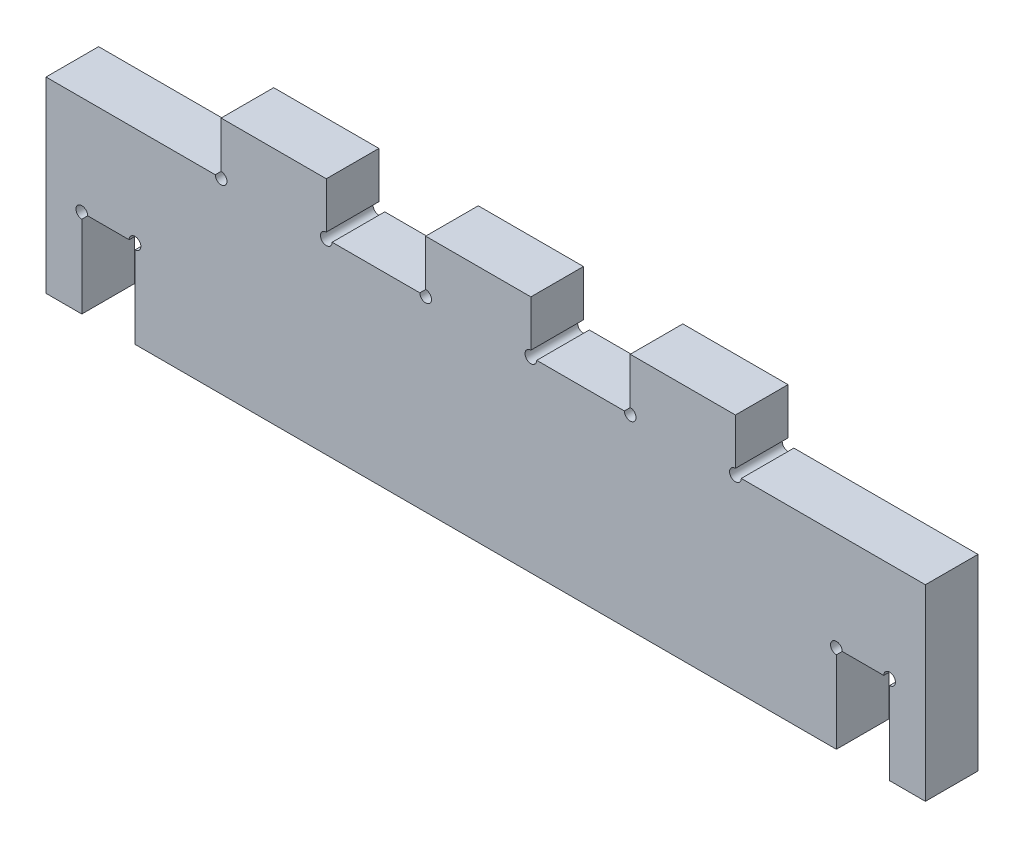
ISO-10303-21;
HEADER;
FILE_DESCRIPTION(('STEP AP214'),'2;1');
FILE_NAME('part.step','',(''),(''),'','','');
FILE_SCHEMA(('AUTOMOTIVE_DESIGN { 1 0 10303 214 1 1 1 1 }'));
ENDSEC;
DATA;
#1=APPLICATION_CONTEXT('core data for automotive mechanical design processes');
#2=APPLICATION_PROTOCOL_DEFINITION('international standard','automotive_design',2000,#1);
#3=PRODUCT_CONTEXT('',#1,'mechanical');
#4=PRODUCT('Part','Part','',(#3));
#5=PRODUCT_RELATED_PRODUCT_CATEGORY('part','',(#4));
#6=PRODUCT_DEFINITION_FORMATION('','',#4);
#7=PRODUCT_DEFINITION_CONTEXT('part definition',#1,'design');
#8=PRODUCT_DEFINITION('design','',#6,#7);
#9=PRODUCT_DEFINITION_SHAPE('','',#8);
#10=(LENGTH_UNIT() NAMED_UNIT(*) SI_UNIT(.MILLI.,.METRE.));
#11=(NAMED_UNIT(*) PLANE_ANGLE_UNIT() SI_UNIT($,.RADIAN.));
#12=(NAMED_UNIT(*) SI_UNIT($,.STERADIAN.) SOLID_ANGLE_UNIT());
#13=UNCERTAINTY_MEASURE_WITH_UNIT(LENGTH_MEASURE(1.E-05),#10,'distance_accuracy_value','');
#14=(GEOMETRIC_REPRESENTATION_CONTEXT(3) GLOBAL_UNCERTAINTY_ASSIGNED_CONTEXT((#13)) GLOBAL_UNIT_ASSIGNED_CONTEXT((#10,
#11,#12)) REPRESENTATION_CONTEXT('',''));
#15=CARTESIAN_POINT('',(0.,0.,0.));
#16=DIRECTION('',(0.,0.,1.));
#17=DIRECTION('',(1.,0.,0.));
#18=AXIS2_PLACEMENT_3D('',#15,#16,#17);
#19=CARTESIAN_POINT('',(-270.05512727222,81.9191441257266,11.0078893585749));
#20=DIRECTION('',(0.,-1.,0.));
#21=DIRECTION('',(0.,0.,-1.));
#22=AXIS2_PLACEMENT_3D('',#19,#20,#21);
#23=PLANE('',#22);
#24=DIRECTION('',(-1.,0.,0.));
#25=VECTOR('',#24,1.);
#26=CARTESIAN_POINT('',(-270.05512727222,81.9191441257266,11.0078893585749));
#27=LINE('',#26,#25);
#28=CARTESIAN_POINT('',(-212.14487272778,81.9191441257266,11.0078893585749));
#29=VERTEX_POINT('',#28);
#30=CARTESIAN_POINT('',(-270.05512727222,81.9191441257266,11.0078893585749));
#31=VERTEX_POINT('',#30);
#32=EDGE_CURVE('E432',#29,#31,#27,.T.);
#33=ORIENTED_EDGE('',*,*,#32,.F.);
#34=DIRECTION('',(0.,0.,1.));
#35=VECTOR('',#34,1.);
#36=CARTESIAN_POINT('',(-212.14487272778,81.9191441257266,-6.99311064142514));
#37=LINE('',#36,#35);
#38=CARTESIAN_POINT('',(-212.14487272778,81.9191441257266,-6.99211064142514));
#39=VERTEX_POINT('',#38);
#40=EDGE_CURVE('E469',#39,#29,#37,.T.);
#41=ORIENTED_EDGE('',*,*,#40,.F.);
#42=DIRECTION('',(-1.,0.,0.));
#43=VECTOR('',#42,1.);
#44=CARTESIAN_POINT('',(-270.05512727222,81.9191441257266,-6.99211064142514));
#45=LINE('',#44,#43);
#46=CARTESIAN_POINT('',(-270.05512727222,81.9191441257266,-6.99211064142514));
#47=VERTEX_POINT('',#46);
#48=EDGE_CURVE('E298',#39,#47,#45,.T.);
#49=ORIENTED_EDGE('',*,*,#48,.T.);
#50=DIRECTION('',(0.,0.,-1.));
#51=VECTOR('',#50,1.);
#52=CARTESIAN_POINT('',(-270.05512727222,81.9191441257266,11.0078893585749));
#53=LINE('',#52,#51);
#54=EDGE_CURVE('E339',#31,#47,#53,.T.);
#55=ORIENTED_EDGE('',*,*,#54,.F.);
#56=EDGE_LOOP('',(#33,#41,#49,#55));
#57=FACE_BOUND('',#56,.T.);
#58=ADVANCED_FACE('F33',(#57),#23,.F.);
#59=CARTESIAN_POINT('',(-142.14487272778,81.9191441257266,-6.99211064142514));
#60=VERTEX_POINT('',#59);
#61=CARTESIAN_POINT('',(-172.14487272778,81.9191441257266,-6.99211064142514));
#62=VERTEX_POINT('',#61);
#63=EDGE_CURVE('E594',#60,#62,#45,.T.);
#64=ORIENTED_EDGE('',*,*,#63,.T.);
#65=DIRECTION('',(0.,0.,1.));
#66=VECTOR('',#65,1.);
#67=CARTESIAN_POINT('',(-172.14487272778,81.9191441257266,-6.99311064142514));
#68=LINE('',#67,#66);
#69=CARTESIAN_POINT('',(-172.14487272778,81.9191441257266,11.0078893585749));
#70=VERTEX_POINT('',#69);
#71=EDGE_CURVE('E512',#70,#62,#68,.F.);
#72=ORIENTED_EDGE('',*,*,#71,.F.);
#73=CARTESIAN_POINT('',(-142.14487272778,81.9191441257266,11.0078893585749));
#74=VERTEX_POINT('',#73);
#75=EDGE_CURVE('E691',#74,#70,#27,.T.);
#76=ORIENTED_EDGE('',*,*,#75,.F.);
#77=DIRECTION('',(0.,0.,1.));
#78=VECTOR('',#77,1.);
#79=CARTESIAN_POINT('',(-142.14487272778,81.9191441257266,-6.99311064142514));
#80=LINE('',#79,#78);
#81=EDGE_CURVE('E504',#60,#74,#80,.T.);
#82=ORIENTED_EDGE('',*,*,#81,.F.);
#83=EDGE_LOOP('',(#64,#72,#76,#82));
#84=FACE_BOUND('',#83,.T.);
#85=ADVANCED_FACE('F568',(#84),#23,.F.);
#86=CARTESIAN_POINT('',(-72.1448727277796,81.9191441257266,-6.99211064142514));
#87=VERTEX_POINT('',#86);
#88=CARTESIAN_POINT('',(-102.14487272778,81.9191441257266,-6.99211064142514));
#89=VERTEX_POINT('',#88);
#90=EDGE_CURVE('E303',#87,#89,#45,.T.);
#91=ORIENTED_EDGE('',*,*,#90,.T.);
#92=DIRECTION('',(0.,0.,1.));
#93=VECTOR('',#92,1.);
#94=CARTESIAN_POINT('',(-102.14487272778,81.9191441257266,-6.99311064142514));
#95=LINE('',#94,#93);
#96=CARTESIAN_POINT('',(-102.14487272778,81.9191441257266,11.0078893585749));
#97=VERTEX_POINT('',#96);
#98=EDGE_CURVE('E495',#97,#89,#95,.F.);
#99=ORIENTED_EDGE('',*,*,#98,.F.);
#100=CARTESIAN_POINT('',(-72.1448727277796,81.9191441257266,11.0078893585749));
#101=VERTEX_POINT('',#100);
#102=EDGE_CURVE('E435',#101,#97,#27,.T.);
#103=ORIENTED_EDGE('',*,*,#102,.F.);
#104=DIRECTION('',(0.,0.,1.));
#105=VECTOR('',#104,1.);
#106=CARTESIAN_POINT('',(-72.1448727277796,81.9191441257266,-6.99311064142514));
#107=LINE('',#106,#105);
#108=EDGE_CURVE('E484',#87,#101,#107,.T.);
#109=ORIENTED_EDGE('',*,*,#108,.F.);
#110=EDGE_LOOP('',(#91,#99,#103,#109));
#111=FACE_BOUND('',#110,.T.);
#112=ADVANCED_FACE('F575',(#111),#23,.F.);
#113=CARTESIAN_POINT('',(30.8551272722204,81.9191441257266,-6.99211064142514));
#114=VERTEX_POINT('',#113);
#115=CARTESIAN_POINT('',(-32.1448727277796,81.9191441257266,-6.99211064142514));
#116=VERTEX_POINT('',#115);
#117=EDGE_CURVE('E299',#114,#116,#45,.T.);
#118=ORIENTED_EDGE('',*,*,#117,.T.);
#119=DIRECTION('',(0.,0.,1.));
#120=VECTOR('',#119,1.);
#121=CARTESIAN_POINT('',(-32.1448727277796,81.9191441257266,-6.99311064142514));
#122=LINE('',#121,#120);
#123=CARTESIAN_POINT('',(-32.1448727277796,81.9191441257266,11.0078893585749));
#124=VERTEX_POINT('',#123);
#125=EDGE_CURVE('E369',#124,#116,#122,.F.);
#126=ORIENTED_EDGE('',*,*,#125,.F.);
#127=CARTESIAN_POINT('',(30.8551272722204,81.9191441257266,11.0078893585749));
#128=VERTEX_POINT('',#127);
#129=EDGE_CURVE('E349',#128,#124,#27,.T.);
#130=ORIENTED_EDGE('',*,*,#129,.F.);
#131=DIRECTION('',(0.,0.,-1.));
#132=VECTOR('',#131,1.);
#133=CARTESIAN_POINT('',(30.8551272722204,81.9191441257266,11.0078893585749));
#134=LINE('',#133,#132);
#135=EDGE_CURVE('E41',#128,#114,#134,.T.);
#136=ORIENTED_EDGE('',*,*,#135,.T.);
#137=EDGE_LOOP('',(#118,#126,#130,#136));
#138=FACE_BOUND('',#137,.T.);
#139=ADVANCED_FACE('F346',(#138),#23,.F.);
#140=CARTESIAN_POINT('',(30.8551272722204,17.7207711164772,11.0078893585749));
#141=DIRECTION('',(0.,1.,0.));
#142=DIRECTION('',(0.,0.,1.));
#143=AXIS2_PLACEMENT_3D('',#140,#141,#142);
#144=PLANE('',#143);
#145=DIRECTION('',(1.,0.,0.));
#146=VECTOR('',#145,1.);
#147=CARTESIAN_POINT('',(30.8551272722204,17.7207711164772,-6.99211064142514));
#148=LINE('',#147,#146);
#149=CARTESIAN_POINT('',(18.6,17.7207711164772,-6.99211064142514));
#150=VERTEX_POINT('',#149);
#151=CARTESIAN_POINT('',(30.8551272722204,17.7207711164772,-6.99211064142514));
#152=VERTEX_POINT('',#151);
#153=EDGE_CURVE('E292',#150,#152,#148,.T.);
#154=ORIENTED_EDGE('',*,*,#153,.T.);
#155=DIRECTION('',(0.,0.,-1.));
#156=VECTOR('',#155,1.);
#157=CARTESIAN_POINT('',(30.8551272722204,17.7207711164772,11.0078893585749));
#158=LINE('',#157,#156);
#159=CARTESIAN_POINT('',(30.8551272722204,17.7207711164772,11.0078893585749));
#160=VERTEX_POINT('',#159);
#161=EDGE_CURVE('E11',#160,#152,#158,.T.);
#162=ORIENTED_EDGE('',*,*,#161,.F.);
#163=DIRECTION('',(1.,0.,0.));
#164=VECTOR('',#163,1.);
#165=CARTESIAN_POINT('',(30.8551272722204,17.7207711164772,11.0078893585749));
#166=LINE('',#165,#164);
#167=CARTESIAN_POINT('',(18.6,17.7207711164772,11.0078893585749));
#168=VERTEX_POINT('',#167);
#169=EDGE_CURVE('E324',#168,#160,#166,.T.);
#170=ORIENTED_EDGE('',*,*,#169,.F.);
#171=DIRECTION('',(0.,0.,-1.));
#172=VECTOR('',#171,1.);
#173=CARTESIAN_POINT('',(18.6,17.7207711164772,11.0078893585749));
#174=LINE('',#173,#172);
#175=EDGE_CURVE('E291',#168,#150,#174,.T.);
#176=ORIENTED_EDGE('',*,*,#175,.T.);
#177=EDGE_LOOP('',(#154,#162,#170,#176));
#178=FACE_BOUND('',#177,.T.);
#179=ADVANCED_FACE('F35',(#178),#144,.F.);
#180=CARTESIAN_POINT('',(30.8551272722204,81.9191441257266,11.0078893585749));
#181=DIRECTION('',(-1.,0.,0.));
#182=DIRECTION('',(0.,-1.,0.));
#183=AXIS2_PLACEMENT_3D('',#180,#181,#182);
#184=PLANE('',#183);
#185=DIRECTION('',(0.,1.,0.));
#186=VECTOR('',#185,1.);
#187=CARTESIAN_POINT('',(30.8551272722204,81.9191441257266,-6.99211064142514));
#188=LINE('',#187,#186);
#189=EDGE_CURVE('E295',#152,#114,#188,.T.);
#190=ORIENTED_EDGE('',*,*,#189,.T.);
#191=ORIENTED_EDGE('',*,*,#135,.F.);
#192=DIRECTION('',(0.,1.,0.));
#193=VECTOR('',#192,1.);
#194=CARTESIAN_POINT('',(30.8551272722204,81.9191441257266,11.0078893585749));
#195=LINE('',#194,#193);
#196=EDGE_CURVE('E430',#160,#128,#195,.T.);
#197=ORIENTED_EDGE('',*,*,#196,.F.);
#198=ORIENTED_EDGE('',*,*,#161,.T.);
#199=EDGE_LOOP('',(#190,#191,#197,#198));
#200=FACE_BOUND('',#199,.T.);
#201=ADVANCED_FACE('F523',(#200),#184,.F.);
#202=CARTESIAN_POINT('',(-270.05512727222,17.8016269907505,11.0078893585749));
#203=DIRECTION('',(1.,0.,0.));
#204=DIRECTION('',(0.,0.,-1.));
#205=AXIS2_PLACEMENT_3D('',#202,#203,#204);
#206=PLANE('',#205);
#207=DIRECTION('',(0.,-1.,0.));
#208=VECTOR('',#207,1.);
#209=CARTESIAN_POINT('',(-270.05512727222,17.8016269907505,-6.99211064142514));
#210=LINE('',#209,#208);
#211=CARTESIAN_POINT('',(-270.05512727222,17.8016269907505,-6.99211064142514));
#212=VERTEX_POINT('',#211);
#213=EDGE_CURVE('E302',#47,#212,#210,.T.);
#214=ORIENTED_EDGE('',*,*,#213,.T.);
#215=DIRECTION('',(0.,0.,-1.));
#216=VECTOR('',#215,1.);
#217=CARTESIAN_POINT('',(-270.05512727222,17.8016269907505,11.0078893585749));
#218=LINE('',#217,#216);
#219=CARTESIAN_POINT('',(-270.05512727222,17.8016269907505,11.0078893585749));
#220=VERTEX_POINT('',#219);
#221=EDGE_CURVE('E336',#220,#212,#218,.T.);
#222=ORIENTED_EDGE('',*,*,#221,.F.);
#223=DIRECTION('',(0.,-1.,0.));
#224=VECTOR('',#223,1.);
#225=CARTESIAN_POINT('',(-270.05512727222,17.8016269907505,11.0078893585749));
#226=LINE('',#225,#224);
#227=EDGE_CURVE('E434',#31,#220,#226,.T.);
#228=ORIENTED_EDGE('',*,*,#227,.F.);
#229=ORIENTED_EDGE('',*,*,#54,.T.);
#230=EDGE_LOOP('',(#214,#222,#228,#229));
#231=FACE_BOUND('',#230,.T.);
#232=ADVANCED_FACE('F604',(#231),#206,.F.);
#233=CARTESIAN_POINT('',(-257.8,17.8016269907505,11.0078893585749));
#234=DIRECTION('',(0.,1.,0.));
#235=DIRECTION('',(0.,0.,1.));
#236=AXIS2_PLACEMENT_3D('',#233,#234,#235);
#237=PLANE('',#236);
#238=DIRECTION('',(1.,0.,0.));
#239=VECTOR('',#238,1.);
#240=CARTESIAN_POINT('',(-257.8,17.8016269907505,-6.99211064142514));
#241=LINE('',#240,#239);
#242=CARTESIAN_POINT('',(-257.8,17.8016269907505,-6.99211064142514));
#243=VERTEX_POINT('',#242);
#244=EDGE_CURVE('E305',#212,#243,#241,.T.);
#245=ORIENTED_EDGE('',*,*,#244,.T.);
#246=DIRECTION('',(0.,0.,-1.));
#247=VECTOR('',#246,1.);
#248=CARTESIAN_POINT('',(-257.8,17.8016269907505,11.0078893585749));
#249=LINE('',#248,#247);
#250=CARTESIAN_POINT('',(-257.8,17.8016269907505,11.0078893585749));
#251=VERTEX_POINT('',#250);
#252=EDGE_CURVE('E333',#251,#243,#249,.T.);
#253=ORIENTED_EDGE('',*,*,#252,.F.);
#254=DIRECTION('',(1.,0.,0.));
#255=VECTOR('',#254,1.);
#256=CARTESIAN_POINT('',(-257.8,17.8016269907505,11.0078893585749));
#257=LINE('',#256,#255);
#258=EDGE_CURVE('E278',#220,#251,#257,.T.);
#259=ORIENTED_EDGE('',*,*,#258,.F.);
#260=ORIENTED_EDGE('',*,*,#221,.T.);
#261=EDGE_LOOP('',(#245,#253,#259,#260));
#262=FACE_BOUND('',#261,.T.);
#263=ADVANCED_FACE('F441',(#262),#237,.F.);
#264=CARTESIAN_POINT('',(-257.8,47.9191441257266,11.0078893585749));
#265=DIRECTION('',(-1.,0.,0.));
#266=DIRECTION('',(0.,0.,1.));
#267=AXIS2_PLACEMENT_3D('',#264,#265,#266);
#268=PLANE('',#267);
#269=DIRECTION('',(0.,1.,0.));
#270=VECTOR('',#269,1.);
#271=CARTESIAN_POINT('',(-257.8,47.9191441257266,-6.99211064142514));
#272=LINE('',#271,#270);
#273=CARTESIAN_POINT('',(-257.8,45.9191441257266,-6.99211064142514));
#274=VERTEX_POINT('',#273);
#275=EDGE_CURVE('E307',#243,#274,#272,.T.);
#276=ORIENTED_EDGE('',*,*,#275,.T.);
#277=DIRECTION('',(0.,0.,1.));
#278=VECTOR('',#277,1.);
#279=CARTESIAN_POINT('',(-257.8,45.9191441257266,-6.99311064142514));
#280=LINE('',#279,#278);
#281=CARTESIAN_POINT('',(-257.8,45.9191441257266,11.0078893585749));
#282=VERTEX_POINT('',#281);
#283=EDGE_CURVE('E48',#282,#274,#280,.F.);
#284=ORIENTED_EDGE('',*,*,#283,.F.);
#285=DIRECTION('',(0.,1.,0.));
#286=VECTOR('',#285,1.);
#287=CARTESIAN_POINT('',(-257.8,47.9191441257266,11.0078893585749));
#288=LINE('',#287,#286);
#289=EDGE_CURVE('E271',#251,#282,#288,.T.);
#290=ORIENTED_EDGE('',*,*,#289,.F.);
#291=ORIENTED_EDGE('',*,*,#252,.T.);
#292=EDGE_LOOP('',(#276,#284,#290,#291));
#293=FACE_BOUND('',#292,.T.);
#294=ADVANCED_FACE('F445',(#293),#268,.F.);
#295=CARTESIAN_POINT('',(-239.6,47.9191441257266,11.0078893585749));
#296=DIRECTION('',(0.,1.,0.));
#297=DIRECTION('',(0.,0.,1.));
#298=AXIS2_PLACEMENT_3D('',#295,#296,#297);
#299=PLANE('',#298);
#300=DIRECTION('',(1.,0.,0.));
#301=VECTOR('',#300,1.);
#302=CARTESIAN_POINT('',(-239.6,47.9191441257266,-6.99211064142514));
#303=LINE('',#302,#301);
#304=CARTESIAN_POINT('',(-255.8,47.9191441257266,-6.99211064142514));
#305=VERTEX_POINT('',#304);
#306=CARTESIAN_POINT('',(-241.6,47.9191441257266,-6.99211064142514));
#307=VERTEX_POINT('',#306);
#308=EDGE_CURVE('E310',#305,#307,#303,.T.);
#309=ORIENTED_EDGE('',*,*,#308,.T.);
#310=DIRECTION('',(0.,0.,1.));
#311=VECTOR('',#310,1.);
#312=CARTESIAN_POINT('',(-241.6,47.9191441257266,-6.99311064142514));
#313=LINE('',#312,#311);
#314=CARTESIAN_POINT('',(-241.6,47.9191441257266,11.0078893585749));
#315=VERTEX_POINT('',#314);
#316=EDGE_CURVE('E56',#315,#307,#313,.F.);
#317=ORIENTED_EDGE('',*,*,#316,.F.);
#318=DIRECTION('',(1.,0.,0.));
#319=VECTOR('',#318,1.);
#320=CARTESIAN_POINT('',(-239.6,47.9191441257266,11.0078893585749));
#321=LINE('',#320,#319);
#322=CARTESIAN_POINT('',(-255.8,47.9191441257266,11.0078893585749));
#323=VERTEX_POINT('',#322);
#324=EDGE_CURVE('E269',#323,#315,#321,.T.);
#325=ORIENTED_EDGE('',*,*,#324,.F.);
#326=DIRECTION('',(0.,0.,1.));
#327=VECTOR('',#326,1.);
#328=CARTESIAN_POINT('',(-255.8,47.9191441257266,-6.99311064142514));
#329=LINE('',#328,#327);
#330=EDGE_CURVE('E252',#305,#323,#329,.T.);
#331=ORIENTED_EDGE('',*,*,#330,.F.);
#332=EDGE_LOOP('',(#309,#317,#325,#331));
#333=FACE_BOUND('',#332,.T.);
#334=ADVANCED_FACE('F273',(#333),#299,.F.);
#335=CARTESIAN_POINT('',(-239.6,17.9191441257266,11.0078893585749));
#336=DIRECTION('',(1.,0.,0.));
#337=DIRECTION('',(0.,0.,-1.));
#338=AXIS2_PLACEMENT_3D('',#335,#336,#337);
#339=PLANE('',#338);
#340=DIRECTION('',(0.,-1.,0.));
#341=VECTOR('',#340,1.);
#342=CARTESIAN_POINT('',(-239.6,17.9191441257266,11.0078893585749));
#343=LINE('',#342,#341);
#344=CARTESIAN_POINT('',(-239.6,45.9191441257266,11.0078893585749));
#345=VERTEX_POINT('',#344);
#346=CARTESIAN_POINT('',(-239.6,17.9191441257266,11.0078893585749));
#347=VERTEX_POINT('',#346);
#348=EDGE_CURVE('E274',#345,#347,#343,.T.);
#349=ORIENTED_EDGE('',*,*,#348,.F.);
#350=DIRECTION('',(0.,0.,1.));
#351=VECTOR('',#350,1.);
#352=CARTESIAN_POINT('',(-239.6,45.9191441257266,-6.99311064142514));
#353=LINE('',#352,#351);
#354=CARTESIAN_POINT('',(-239.6,45.9191441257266,-6.99211064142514));
#355=VERTEX_POINT('',#354);
#356=EDGE_CURVE('E449',#355,#345,#353,.T.);
#357=ORIENTED_EDGE('',*,*,#356,.F.);
#358=DIRECTION('',(0.,-1.,0.));
#359=VECTOR('',#358,1.);
#360=CARTESIAN_POINT('',(-239.6,17.9191441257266,-6.99211064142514));
#361=LINE('',#360,#359);
#362=CARTESIAN_POINT('',(-239.6,17.9191441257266,-6.99211064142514));
#363=VERTEX_POINT('',#362);
#364=EDGE_CURVE('E312',#355,#363,#361,.T.);
#365=ORIENTED_EDGE('',*,*,#364,.T.);
#366=DIRECTION('',(0.,0.,-1.));
#367=VECTOR('',#366,1.);
#368=CARTESIAN_POINT('',(-239.6,17.9191441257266,11.0078893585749));
#369=LINE('',#368,#367);
#370=EDGE_CURVE('E330',#347,#363,#369,.T.);
#371=ORIENTED_EDGE('',*,*,#370,.F.);
#372=EDGE_LOOP('',(#349,#357,#365,#371));
#373=FACE_BOUND('',#372,.T.);
#374=ADVANCED_FACE('F557',(#373),#339,.F.);
#375=CARTESIAN_POINT('',(0.400000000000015,17.9191441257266,11.0078893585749));
#376=DIRECTION('',(0.,1.,0.));
#377=DIRECTION('',(-1.,0.,0.));
#378=AXIS2_PLACEMENT_3D('',#375,#376,#377);
#379=PLANE('',#378);
#380=DIRECTION('',(1.,0.,0.));
#381=VECTOR('',#380,1.);
#382=CARTESIAN_POINT('',(0.400000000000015,17.9191441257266,-6.99211064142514));
#383=LINE('',#382,#381);
#384=CARTESIAN_POINT('',(0.400000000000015,17.9191441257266,-6.99211064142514));
#385=VERTEX_POINT('',#384);
#386=EDGE_CURVE('E314',#363,#385,#383,.T.);
#387=ORIENTED_EDGE('',*,*,#386,.T.);
#388=DIRECTION('',(0.,0.,-1.));
#389=VECTOR('',#388,1.);
#390=CARTESIAN_POINT('',(0.400000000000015,17.9191441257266,11.0078893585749));
#391=LINE('',#390,#389);
#392=CARTESIAN_POINT('',(0.400000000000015,17.9191441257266,11.0078893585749));
#393=VERTEX_POINT('',#392);
#394=EDGE_CURVE('E327',#393,#385,#391,.T.);
#395=ORIENTED_EDGE('',*,*,#394,.F.);
#396=DIRECTION('',(1.,0.,0.));
#397=VECTOR('',#396,1.);
#398=CARTESIAN_POINT('',(0.400000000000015,17.9191441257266,11.0078893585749));
#399=LINE('',#398,#397);
#400=EDGE_CURVE('E276',#347,#393,#399,.T.);
#401=ORIENTED_EDGE('',*,*,#400,.F.);
#402=ORIENTED_EDGE('',*,*,#370,.T.);
#403=EDGE_LOOP('',(#387,#395,#401,#402));
#404=FACE_BOUND('',#403,.T.);
#405=ADVANCED_FACE('F551',(#404),#379,.F.);
#406=CARTESIAN_POINT('',(0.400000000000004,47.9191441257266,11.0078893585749));
#407=DIRECTION('',(-1.,0.,0.));
#408=DIRECTION('',(0.,-1.,0.));
#409=AXIS2_PLACEMENT_3D('',#406,#407,#408);
#410=PLANE('',#409);
#411=DIRECTION('',(0.,1.,0.));
#412=VECTOR('',#411,1.);
#413=CARTESIAN_POINT('',(0.400000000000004,47.9191441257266,-6.99211064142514));
#414=LINE('',#413,#412);
#415=CARTESIAN_POINT('',(0.400000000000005,45.9191441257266,-6.99211064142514));
#416=VERTEX_POINT('',#415);
#417=EDGE_CURVE('E316',#385,#416,#414,.T.);
#418=ORIENTED_EDGE('',*,*,#417,.T.);
#419=DIRECTION('',(0.,0.,1.));
#420=VECTOR('',#419,1.);
#421=CARTESIAN_POINT('',(0.400000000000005,45.9191441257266,-6.99311064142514));
#422=LINE('',#421,#420);
#423=CARTESIAN_POINT('',(0.400000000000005,45.9191441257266,11.0078893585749));
#424=VERTEX_POINT('',#423);
#425=EDGE_CURVE('E461',#424,#416,#422,.F.);
#426=ORIENTED_EDGE('',*,*,#425,.F.);
#427=DIRECTION('',(0.,1.,0.));
#428=VECTOR('',#427,1.);
#429=CARTESIAN_POINT('',(0.400000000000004,47.9191441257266,11.0078893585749));
#430=LINE('',#429,#428);
#431=EDGE_CURVE('E283',#393,#424,#430,.T.);
#432=ORIENTED_EDGE('',*,*,#431,.F.);
#433=ORIENTED_EDGE('',*,*,#394,.T.);
#434=EDGE_LOOP('',(#418,#426,#432,#433));
#435=FACE_BOUND('',#434,.T.);
#436=ADVANCED_FACE('F546',(#435),#410,.F.);
#437=CARTESIAN_POINT('',(18.6,47.9191441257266,11.0078893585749));
#438=DIRECTION('',(0.,1.,0.));
#439=DIRECTION('',(0.,0.,1.));
#440=AXIS2_PLACEMENT_3D('',#437,#438,#439);
#441=PLANE('',#440);
#442=DIRECTION('',(1.,0.,0.));
#443=VECTOR('',#442,1.);
#444=CARTESIAN_POINT('',(18.6,47.9191441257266,-6.99211064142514));
#445=LINE('',#444,#443);
#446=CARTESIAN_POINT('',(2.4,47.9191441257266,-6.99211064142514));
#447=VERTEX_POINT('',#446);
#448=CARTESIAN_POINT('',(16.6,47.9191441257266,-6.99211064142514));
#449=VERTEX_POINT('',#448);
#450=EDGE_CURVE('E319',#447,#449,#445,.T.);
#451=ORIENTED_EDGE('',*,*,#450,.T.);
#452=DIRECTION('',(0.,0.,1.));
#453=VECTOR('',#452,1.);
#454=CARTESIAN_POINT('',(16.6,47.9191441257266,-6.99311064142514));
#455=LINE('',#454,#453);
#456=CARTESIAN_POINT('',(16.6,47.9191441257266,11.0078893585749));
#457=VERTEX_POINT('',#456);
#458=EDGE_CURVE('E452',#457,#449,#455,.F.);
#459=ORIENTED_EDGE('',*,*,#458,.F.);
#460=DIRECTION('',(1.,0.,0.));
#461=VECTOR('',#460,1.);
#462=CARTESIAN_POINT('',(18.6,47.9191441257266,11.0078893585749));
#463=LINE('',#462,#461);
#464=CARTESIAN_POINT('',(2.4,47.9191441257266,11.0078893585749));
#465=VERTEX_POINT('',#464);
#466=EDGE_CURVE('E286',#465,#457,#463,.T.);
#467=ORIENTED_EDGE('',*,*,#466,.F.);
#468=DIRECTION('',(0.,0.,1.));
#469=VECTOR('',#468,1.);
#470=CARTESIAN_POINT('',(2.4,47.9191441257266,-6.99311064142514));
#471=LINE('',#470,#469);
#472=EDGE_CURVE('E459',#447,#465,#471,.T.);
#473=ORIENTED_EDGE('',*,*,#472,.F.);
#474=EDGE_LOOP('',(#451,#459,#467,#473));
#475=FACE_BOUND('',#474,.T.);
#476=ADVANCED_FACE('F540',(#475),#441,.F.);
#477=CARTESIAN_POINT('',(18.6,17.7207711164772,11.0078893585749));
#478=DIRECTION('',(1.,0.,0.));
#479=DIRECTION('',(0.,0.,-1.));
#480=AXIS2_PLACEMENT_3D('',#477,#478,#479);
#481=PLANE('',#480);
#482=DIRECTION('',(0.,-1.,0.));
#483=VECTOR('',#482,1.);
#484=CARTESIAN_POINT('',(18.6,17.7207711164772,11.0078893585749));
#485=LINE('',#484,#483);
#486=CARTESIAN_POINT('',(18.6,45.9191441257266,11.0078893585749));
#487=VERTEX_POINT('',#486);
#488=EDGE_CURVE('E289',#487,#168,#485,.T.);
#489=ORIENTED_EDGE('',*,*,#488,.F.);
#490=DIRECTION('',(0.,0.,1.));
#491=VECTOR('',#490,1.);
#492=CARTESIAN_POINT('',(18.6,45.9191441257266,-6.99311064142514));
#493=LINE('',#492,#491);
#494=CARTESIAN_POINT('',(18.6,45.9191441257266,-6.99211064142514));
#495=VERTEX_POINT('',#494);
#496=EDGE_CURVE('E450',#495,#487,#493,.T.);
#497=ORIENTED_EDGE('',*,*,#496,.F.);
#498=DIRECTION('',(0.,-1.,0.));
#499=VECTOR('',#498,1.);
#500=CARTESIAN_POINT('',(18.6,17.7207711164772,-6.99211064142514));
#501=LINE('',#500,#499);
#502=EDGE_CURVE('E322',#495,#150,#501,.T.);
#503=ORIENTED_EDGE('',*,*,#502,.T.);
#504=ORIENTED_EDGE('',*,*,#175,.F.);
#505=EDGE_LOOP('',(#489,#497,#503,#504));
#506=FACE_BOUND('',#505,.T.);
#507=ADVANCED_FACE('F531',(#506),#481,.F.);
#508=CARTESIAN_POINT('',(0.,0.,11.0078893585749));
#509=DIRECTION('',(0.,0.,-1.));
#510=DIRECTION('',(-1.,0.,0.));
#511=AXIS2_PLACEMENT_3D('',#508,#509,#510);
#512=PLANE('',#511);
#513=DIRECTION('',(0.,-1.,0.));
#514=VECTOR('',#513,1.);
#515=CARTESIAN_POINT('',(-210.14487272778,99.7191441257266,11.0078893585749));
#516=LINE('',#515,#514);
#517=CARTESIAN_POINT('',(-210.14487272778,99.7191441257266,11.0078893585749));
#518=VERTEX_POINT('',#517);
#519=CARTESIAN_POINT('',(-210.14487272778,83.9191441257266,11.0078893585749));
#520=VERTEX_POINT('',#519);
#521=EDGE_CURVE('E387',#518,#520,#516,.T.);
#522=ORIENTED_EDGE('',*,*,#521,.T.);
#523=CARTESIAN_POINT('',(-210.14487272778,81.9191441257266,11.0078893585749));
#524=DIRECTION('',(0.,0.,1.));
#525=DIRECTION('',(1.,0.,0.));
#526=AXIS2_PLACEMENT_3D('',#523,#524,#525);
#527=CIRCLE('',#526,2.);
#528=EDGE_CURVE('E472',#29,#520,#527,.T.);
#529=ORIENTED_EDGE('',*,*,#528,.F.);
#530=ORIENTED_EDGE('',*,*,#32,.T.);
#531=ORIENTED_EDGE('',*,*,#227,.T.);
#532=ORIENTED_EDGE('',*,*,#258,.T.);
#533=ORIENTED_EDGE('',*,*,#289,.T.);
#534=CARTESIAN_POINT('',(-257.8,47.9191441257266,11.0078893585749));
#535=DIRECTION('',(0.,0.,1.));
#536=DIRECTION('',(1.,0.,0.));
#537=AXIS2_PLACEMENT_3D('',#534,#535,#536);
#538=CIRCLE('',#537,2.);
#539=EDGE_CURVE('E255',#323,#282,#538,.T.);
#540=ORIENTED_EDGE('',*,*,#539,.F.);
#541=ORIENTED_EDGE('',*,*,#324,.T.);
#542=CARTESIAN_POINT('',(-239.6,47.9191441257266,11.0078893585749));
#543=DIRECTION('',(0.,0.,1.));
#544=DIRECTION('',(1.,0.,0.));
#545=AXIS2_PLACEMENT_3D('',#542,#543,#544);
#546=CIRCLE('',#545,2.);
#547=EDGE_CURVE('E479',#345,#315,#546,.T.);
#548=ORIENTED_EDGE('',*,*,#547,.F.);
#549=ORIENTED_EDGE('',*,*,#348,.T.);
#550=ORIENTED_EDGE('',*,*,#400,.T.);
#551=ORIENTED_EDGE('',*,*,#431,.T.);
#552=CARTESIAN_POINT('',(0.400000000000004,47.9191441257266,11.0078893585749));
#553=DIRECTION('',(0.,0.,1.));
#554=DIRECTION('',(1.,0.,0.));
#555=AXIS2_PLACEMENT_3D('',#552,#553,#554);
#556=CIRCLE('',#555,2.);
#557=EDGE_CURVE('E463',#465,#424,#556,.T.);
#558=ORIENTED_EDGE('',*,*,#557,.F.);
#559=ORIENTED_EDGE('',*,*,#466,.T.);
#560=CARTESIAN_POINT('',(18.6,47.9191441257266,11.0078893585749));
#561=DIRECTION('',(0.,0.,1.));
#562=DIRECTION('',(1.,0.,0.));
#563=AXIS2_PLACEMENT_3D('',#560,#561,#562);
#564=CIRCLE('',#563,2.);
#565=EDGE_CURVE('E455',#487,#457,#564,.T.);
#566=ORIENTED_EDGE('',*,*,#565,.F.);
#567=ORIENTED_EDGE('',*,*,#488,.T.);
#568=ORIENTED_EDGE('',*,*,#169,.T.);
#569=ORIENTED_EDGE('',*,*,#196,.T.);
#570=ORIENTED_EDGE('',*,*,#129,.T.);
#571=CARTESIAN_POINT('',(-34.1448727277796,81.9191441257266,11.0078893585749));
#572=DIRECTION('',(0.,0.,1.));
#573=DIRECTION('',(1.,0.,0.));
#574=AXIS2_PLACEMENT_3D('',#571,#572,#573);
#575=CIRCLE('',#574,2.);
#576=CARTESIAN_POINT('',(-34.1448727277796,83.9191441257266,11.0078893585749));
#577=VERTEX_POINT('',#576);
#578=EDGE_CURVE('E364',#577,#124,#575,.T.);
#579=ORIENTED_EDGE('',*,*,#578,.F.);
#580=DIRECTION('',(0.,-1.,0.));
#581=VECTOR('',#580,1.);
#582=CARTESIAN_POINT('',(-34.1448727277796,99.7191441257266,11.0078893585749));
#583=LINE('',#582,#581);
#584=CARTESIAN_POINT('',(-34.1448727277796,99.7191441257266,11.0078893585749));
#585=VERTEX_POINT('',#584);
#586=EDGE_CURVE('E423',#585,#577,#583,.T.);
#587=ORIENTED_EDGE('',*,*,#586,.F.);
#588=DIRECTION('',(1.,0.,0.));
#589=VECTOR('',#588,1.);
#590=CARTESIAN_POINT('',(-70.1448727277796,99.7191441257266,11.0078893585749));
#591=LINE('',#590,#589);
#592=CARTESIAN_POINT('',(-70.1448727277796,99.7191441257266,11.0078893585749));
#593=VERTEX_POINT('',#592);
#594=EDGE_CURVE('E413',#593,#585,#591,.T.);
#595=ORIENTED_EDGE('',*,*,#594,.F.);
#596=DIRECTION('',(0.,-1.,0.));
#597=VECTOR('',#596,1.);
#598=CARTESIAN_POINT('',(-70.1448727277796,99.7191441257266,11.0078893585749));
#599=LINE('',#598,#597);
#600=CARTESIAN_POINT('',(-70.1448727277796,83.9191441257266,11.0078893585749));
#601=VERTEX_POINT('',#600);
#602=EDGE_CURVE('E296',#593,#601,#599,.T.);
#603=ORIENTED_EDGE('',*,*,#602,.T.);
#604=CARTESIAN_POINT('',(-70.1448727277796,81.9191441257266,11.0078893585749));
#605=DIRECTION('',(0.,0.,1.));
#606=DIRECTION('',(1.,0.,0.));
#607=AXIS2_PLACEMENT_3D('',#604,#605,#606);
#608=CIRCLE('',#607,2.);
#609=EDGE_CURVE('E487',#101,#601,#608,.T.);
#610=ORIENTED_EDGE('',*,*,#609,.F.);
#611=ORIENTED_EDGE('',*,*,#102,.T.);
#612=CARTESIAN_POINT('',(-104.14487272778,81.9191441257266,11.0078893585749));
#613=DIRECTION('',(0.,0.,1.));
#614=DIRECTION('',(1.,0.,0.));
#615=AXIS2_PLACEMENT_3D('',#612,#613,#614);
#616=CIRCLE('',#615,2.);
#617=CARTESIAN_POINT('',(-104.14487272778,83.9191441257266,11.0078893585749));
#618=VERTEX_POINT('',#617);
#619=EDGE_CURVE('E498',#618,#97,#616,.T.);
#620=ORIENTED_EDGE('',*,*,#619,.F.);
#621=DIRECTION('',(0.,-1.,0.));
#622=VECTOR('',#621,1.);
#623=CARTESIAN_POINT('',(-104.14487272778,99.7191441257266,11.0078893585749));
#624=LINE('',#623,#622);
#625=CARTESIAN_POINT('',(-104.14487272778,99.7191441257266,11.0078893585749));
#626=VERTEX_POINT('',#625);
#627=EDGE_CURVE('E404',#626,#618,#624,.T.);
#628=ORIENTED_EDGE('',*,*,#627,.F.);
#629=DIRECTION('',(1.,0.,0.));
#630=VECTOR('',#629,1.);
#631=CARTESIAN_POINT('',(-140.14487272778,99.7191441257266,11.0078893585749));
#632=LINE('',#631,#630);
#633=CARTESIAN_POINT('',(-140.14487272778,99.7191441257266,11.0078893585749));
#634=VERTEX_POINT('',#633);
#635=EDGE_CURVE('E392',#634,#626,#632,.T.);
#636=ORIENTED_EDGE('',*,*,#635,.F.);
#637=DIRECTION('',(0.,-1.,0.));
#638=VECTOR('',#637,1.);
#639=CARTESIAN_POINT('',(-140.14487272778,99.7191441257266,11.0078893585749));
#640=LINE('',#639,#638);
#641=CARTESIAN_POINT('',(-140.14487272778,83.9191441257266,11.0078893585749));
#642=VERTEX_POINT('',#641);
#643=EDGE_CURVE('E407',#634,#642,#640,.T.);
#644=ORIENTED_EDGE('',*,*,#643,.T.);
#645=CARTESIAN_POINT('',(-140.14487272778,81.9191441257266,11.0078893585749));
#646=DIRECTION('',(0.,0.,1.));
#647=DIRECTION('',(1.,0.,0.));
#648=AXIS2_PLACEMENT_3D('',#645,#646,#647);
#649=CIRCLE('',#648,2.);
#650=EDGE_CURVE('E507',#74,#642,#649,.T.);
#651=ORIENTED_EDGE('',*,*,#650,.F.);
#652=ORIENTED_EDGE('',*,*,#75,.T.);
#653=CARTESIAN_POINT('',(-174.14487272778,81.9191441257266,11.0078893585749));
#654=DIRECTION('',(0.,0.,1.));
#655=DIRECTION('',(1.,0.,0.));
#656=AXIS2_PLACEMENT_3D('',#653,#654,#655);
#657=CIRCLE('',#656,2.);
#658=CARTESIAN_POINT('',(-174.14487272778,83.9191441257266,11.0078893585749));
#659=VERTEX_POINT('',#658);
#660=EDGE_CURVE('E514',#659,#70,#657,.T.);
#661=ORIENTED_EDGE('',*,*,#660,.F.);
#662=DIRECTION('',(0.,-1.,0.));
#663=VECTOR('',#662,1.);
#664=CARTESIAN_POINT('',(-174.14487272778,99.7191441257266,11.0078893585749));
#665=LINE('',#664,#663);
#666=CARTESIAN_POINT('',(-174.14487272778,99.7191441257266,11.0078893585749));
#667=VERTEX_POINT('',#666);
#668=EDGE_CURVE('E384',#667,#659,#665,.T.);
#669=ORIENTED_EDGE('',*,*,#668,.F.);
#670=DIRECTION('',(1.,0.,0.));
#671=VECTOR('',#670,1.);
#672=CARTESIAN_POINT('',(-210.14487272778,99.7191441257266,11.0078893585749));
#673=LINE('',#672,#671);
#674=EDGE_CURVE('E367',#518,#667,#673,.T.);
#675=ORIENTED_EDGE('',*,*,#674,.F.);
#676=EDGE_LOOP('',(#522,#529,#530,#531,#532,#533,#540,#541,#548,#549,#550,#551,#558,#559,#566,
#567,#568,#569,#570,#579,#587,#595,#603,#610,#611,#620,#628,#636,#644,#651,#652,#661,#669,#675));
#677=FACE_BOUND('',#676,.T.);
#678=ADVANCED_FACE('F267',(#677),#512,.F.);
#679=CARTESIAN_POINT('',(0.,0.,-6.99211064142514));
#680=DIRECTION('',(0.,0.,-1.));
#681=DIRECTION('',(-1.,0.,0.));
#682=AXIS2_PLACEMENT_3D('',#679,#680,#681);
#683=PLANE('',#682);
#684=CARTESIAN_POINT('',(-210.14487272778,81.9191441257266,-6.99211064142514));
#685=DIRECTION('',(0.,0.,-1.));
#686=DIRECTION('',(-1.,0.,0.));
#687=AXIS2_PLACEMENT_3D('',#684,#685,#686);
#688=CIRCLE('',#687,2.);
#689=CARTESIAN_POINT('',(-210.14487272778,83.9191441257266,-6.9921106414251));
#690=VERTEX_POINT('',#689);
#691=EDGE_CURVE('E474',#39,#690,#688,.F.);
#692=ORIENTED_EDGE('',*,*,#691,.T.);
#693=DIRECTION('',(0.,-1.,0.));
#694=VECTOR('',#693,1.);
#695=CARTESIAN_POINT('',(-210.14487272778,99.7191441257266,-6.9921106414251));
#696=LINE('',#695,#694);
#697=CARTESIAN_POINT('',(-210.14487272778,99.7191441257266,-6.9921106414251));
#698=VERTEX_POINT('',#697);
#699=EDGE_CURVE('E378',#698,#690,#696,.T.);
#700=ORIENTED_EDGE('',*,*,#699,.F.);
#701=DIRECTION('',(-1.,0.,0.));
#702=VECTOR('',#701,1.);
#703=CARTESIAN_POINT('',(-210.14487272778,99.7191441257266,-6.9921106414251));
#704=LINE('',#703,#702);
#705=CARTESIAN_POINT('',(-174.14487272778,99.7191441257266,-6.99211064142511));
#706=VERTEX_POINT('',#705);
#707=EDGE_CURVE('E376',#706,#698,#704,.T.);
#708=ORIENTED_EDGE('',*,*,#707,.F.);
#709=DIRECTION('',(0.,-1.,0.));
#710=VECTOR('',#709,1.);
#711=CARTESIAN_POINT('',(-174.14487272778,99.7191441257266,-6.99211064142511));
#712=LINE('',#711,#710);
#713=CARTESIAN_POINT('',(-174.14487272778,83.9191441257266,-6.99211064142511));
#714=VERTEX_POINT('',#713);
#715=EDGE_CURVE('E381',#706,#714,#712,.T.);
#716=ORIENTED_EDGE('',*,*,#715,.T.);
#717=CARTESIAN_POINT('',(-174.14487272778,81.9191441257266,-6.99211064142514));
#718=DIRECTION('',(0.,0.,-1.));
#719=DIRECTION('',(-1.,0.,0.));
#720=AXIS2_PLACEMENT_3D('',#717,#718,#719);
#721=CIRCLE('',#720,2.);
#722=EDGE_CURVE('E505',#714,#62,#721,.F.);
#723=ORIENTED_EDGE('',*,*,#722,.T.);
#724=ORIENTED_EDGE('',*,*,#63,.F.);
#725=CARTESIAN_POINT('',(-140.14487272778,81.9191441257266,-6.99211064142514));
#726=DIRECTION('',(0.,0.,-1.));
#727=DIRECTION('',(-1.,0.,0.));
#728=AXIS2_PLACEMENT_3D('',#725,#726,#727);
#729=CIRCLE('',#728,2.);
#730=CARTESIAN_POINT('',(-140.14487272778,83.9191441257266,-6.9921106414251));
#731=VERTEX_POINT('',#730);
#732=EDGE_CURVE('E496',#60,#731,#729,.F.);
#733=ORIENTED_EDGE('',*,*,#732,.T.);
#734=DIRECTION('',(0.,-1.,0.));
#735=VECTOR('',#734,1.);
#736=CARTESIAN_POINT('',(-140.14487272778,99.7191441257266,-6.9921106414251));
#737=LINE('',#736,#735);
#738=CARTESIAN_POINT('',(-140.14487272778,99.7191441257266,-6.9921106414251));
#739=VERTEX_POINT('',#738);
#740=EDGE_CURVE('E398',#739,#731,#737,.T.);
#741=ORIENTED_EDGE('',*,*,#740,.F.);
#742=DIRECTION('',(-1.,0.,0.));
#743=VECTOR('',#742,1.);
#744=CARTESIAN_POINT('',(-140.14487272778,99.7191441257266,-6.9921106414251));
#745=LINE('',#744,#743);
#746=CARTESIAN_POINT('',(-104.14487272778,99.7191441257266,-6.99211064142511));
#747=VERTEX_POINT('',#746);
#748=EDGE_CURVE('E396',#747,#739,#745,.T.);
#749=ORIENTED_EDGE('',*,*,#748,.F.);
#750=DIRECTION('',(0.,-1.,0.));
#751=VECTOR('',#750,1.);
#752=CARTESIAN_POINT('',(-104.14487272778,99.7191441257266,-6.99211064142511));
#753=LINE('',#752,#751);
#754=CARTESIAN_POINT('',(-104.14487272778,83.9191441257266,-6.99211064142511));
#755=VERTEX_POINT('',#754);
#756=EDGE_CURVE('E401',#747,#755,#753,.T.);
#757=ORIENTED_EDGE('',*,*,#756,.T.);
#758=CARTESIAN_POINT('',(-104.14487272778,81.9191441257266,-6.99211064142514));
#759=DIRECTION('',(0.,0.,-1.));
#760=DIRECTION('',(-1.,0.,0.));
#761=AXIS2_PLACEMENT_3D('',#758,#759,#760);
#762=CIRCLE('',#761,2.);
#763=EDGE_CURVE('E485',#755,#89,#762,.F.);
#764=ORIENTED_EDGE('',*,*,#763,.T.);
#765=ORIENTED_EDGE('',*,*,#90,.F.);
#766=CARTESIAN_POINT('',(-70.1448727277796,81.9191441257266,-6.99211064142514));
#767=DIRECTION('',(0.,0.,-1.));
#768=DIRECTION('',(-1.,0.,0.));
#769=AXIS2_PLACEMENT_3D('',#766,#767,#768);
#770=CIRCLE('',#769,2.);
#771=CARTESIAN_POINT('',(-70.1448727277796,83.9191441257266,-6.99211064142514));
#772=VERTEX_POINT('',#771);
#773=EDGE_CURVE('E489',#87,#772,#770,.F.);
#774=ORIENTED_EDGE('',*,*,#773,.T.);
#775=DIRECTION('',(0.,-1.,0.));
#776=VECTOR('',#775,1.);
#777=CARTESIAN_POINT('',(-70.1448727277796,99.7191441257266,-6.9921106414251));
#778=LINE('',#777,#776);
#779=CARTESIAN_POINT('',(-70.1448727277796,99.7191441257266,-6.9921106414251));
#780=VERTEX_POINT('',#779);
#781=EDGE_CURVE('E419',#780,#772,#778,.T.);
#782=ORIENTED_EDGE('',*,*,#781,.F.);
#783=DIRECTION('',(-1.,0.,0.));
#784=VECTOR('',#783,1.);
#785=CARTESIAN_POINT('',(-70.1448727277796,99.7191441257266,-6.9921106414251));
#786=LINE('',#785,#784);
#787=CARTESIAN_POINT('',(-34.1448727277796,99.7191441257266,-6.99211064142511));
#788=VERTEX_POINT('',#787);
#789=EDGE_CURVE('E417',#788,#780,#786,.T.);
#790=ORIENTED_EDGE('',*,*,#789,.F.);
#791=DIRECTION('',(0.,-1.,0.));
#792=VECTOR('',#791,1.);
#793=CARTESIAN_POINT('',(-34.1448727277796,99.7191441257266,-6.99211064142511));
#794=LINE('',#793,#792);
#795=CARTESIAN_POINT('',(-34.1448727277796,83.9191441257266,-6.99211064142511));
#796=VERTEX_POINT('',#795);
#797=EDGE_CURVE('E360',#788,#796,#794,.T.);
#798=ORIENTED_EDGE('',*,*,#797,.T.);
#799=CARTESIAN_POINT('',(-34.1448727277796,81.9191441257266,-6.99211064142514));
#800=DIRECTION('',(0.,0.,-1.));
#801=DIRECTION('',(-1.,0.,0.));
#802=AXIS2_PLACEMENT_3D('',#799,#800,#801);
#803=CIRCLE('',#802,2.);
#804=EDGE_CURVE('E357',#796,#116,#803,.F.);
#805=ORIENTED_EDGE('',*,*,#804,.T.);
#806=ORIENTED_EDGE('',*,*,#117,.F.);
#807=ORIENTED_EDGE('',*,*,#189,.F.);
#808=ORIENTED_EDGE('',*,*,#153,.F.);
#809=ORIENTED_EDGE('',*,*,#502,.F.);
#810=CARTESIAN_POINT('',(18.6,47.9191441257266,-6.99211064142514));
#811=DIRECTION('',(0.,0.,-1.));
#812=DIRECTION('',(-1.,0.,0.));
#813=AXIS2_PLACEMENT_3D('',#810,#811,#812);
#814=CIRCLE('',#813,2.);
#815=EDGE_CURVE('E261',#495,#449,#814,.F.);
#816=ORIENTED_EDGE('',*,*,#815,.T.);
#817=ORIENTED_EDGE('',*,*,#450,.F.);
#818=CARTESIAN_POINT('',(0.400000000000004,47.9191441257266,-6.99211064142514));
#819=DIRECTION('',(0.,0.,-1.));
#820=DIRECTION('',(-1.,0.,0.));
#821=AXIS2_PLACEMENT_3D('',#818,#819,#820);
#822=CIRCLE('',#821,2.);
#823=EDGE_CURVE('E453',#447,#416,#822,.F.);
#824=ORIENTED_EDGE('',*,*,#823,.T.);
#825=ORIENTED_EDGE('',*,*,#417,.F.);
#826=ORIENTED_EDGE('',*,*,#386,.F.);
#827=ORIENTED_EDGE('',*,*,#364,.F.);
#828=CARTESIAN_POINT('',(-239.6,47.9191441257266,-6.99211064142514));
#829=DIRECTION('',(0.,0.,-1.));
#830=DIRECTION('',(-1.,0.,0.));
#831=AXIS2_PLACEMENT_3D('',#828,#829,#830);
#832=CIRCLE('',#831,2.);
#833=EDGE_CURVE('E470',#355,#307,#832,.F.);
#834=ORIENTED_EDGE('',*,*,#833,.T.);
#835=ORIENTED_EDGE('',*,*,#308,.F.);
#836=CARTESIAN_POINT('',(-257.8,47.9191441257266,-6.99211064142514));
#837=DIRECTION('',(0.,0.,-1.));
#838=DIRECTION('',(-1.,0.,0.));
#839=AXIS2_PLACEMENT_3D('',#836,#837,#838);
#840=CIRCLE('',#839,2.);
#841=EDGE_CURVE('E256',#305,#274,#840,.F.);
#842=ORIENTED_EDGE('',*,*,#841,.T.);
#843=ORIENTED_EDGE('',*,*,#275,.F.);
#844=ORIENTED_EDGE('',*,*,#244,.F.);
#845=ORIENTED_EDGE('',*,*,#213,.F.);
#846=ORIENTED_EDGE('',*,*,#48,.F.);
#847=EDGE_LOOP('',(#692,#700,#708,#716,#723,#724,#733,#741,#749,#757,#764,#765,#774,#782,#790,
#798,#805,#806,#807,#808,#809,#816,#817,#824,#825,#826,#827,#834,#835,#842,#843,#844,#845,#846));
#848=FACE_BOUND('',#847,.T.);
#849=ADVANCED_FACE('F354',(#848),#683,.T.);
#850=CARTESIAN_POINT('',(-70.1448727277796,99.7191441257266,11.0078893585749));
#851=DIRECTION('',(1.,0.,0.));
#852=DIRECTION('',(0.,0.,-1.));
#853=AXIS2_PLACEMENT_3D('',#850,#851,#852);
#854=PLANE('',#853);
#855=ORIENTED_EDGE('',*,*,#781,.T.);
#856=DIRECTION('',(0.,0.,1.));
#857=VECTOR('',#856,1.);
#858=CARTESIAN_POINT('',(-70.1448727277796,83.9191441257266,-6.99311064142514));
#859=LINE('',#858,#857);
#860=EDGE_CURVE('E482',#601,#772,#859,.F.);
#861=ORIENTED_EDGE('',*,*,#860,.F.);
#862=ORIENTED_EDGE('',*,*,#602,.F.);
#863=DIRECTION('',(0.,0.,1.));
#864=VECTOR('',#863,1.);
#865=CARTESIAN_POINT('',(-70.1448727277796,99.7191441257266,11.0078893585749));
#866=LINE('',#865,#864);
#867=EDGE_CURVE('E410',#780,#593,#866,.T.);
#868=ORIENTED_EDGE('',*,*,#867,.F.);
#869=EDGE_LOOP('',(#855,#861,#862,#868));
#870=FACE_BOUND('',#869,.T.);
#871=ADVANCED_FACE('F627',(#870),#854,.F.);
#872=CARTESIAN_POINT('',(-34.1448727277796,99.7191441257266,11.0078893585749));
#873=DIRECTION('',(-1.,0.,0.));
#874=DIRECTION('',(0.,0.,1.));
#875=AXIS2_PLACEMENT_3D('',#872,#873,#874);
#876=PLANE('',#875);
#877=ORIENTED_EDGE('',*,*,#586,.T.);
#878=DIRECTION('',(0.,0.,1.));
#879=VECTOR('',#878,1.);
#880=CARTESIAN_POINT('',(-34.1448727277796,83.9191441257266,-6.99311064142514));
#881=LINE('',#880,#879);
#882=EDGE_CURVE('E492',#796,#577,#881,.T.);
#883=ORIENTED_EDGE('',*,*,#882,.F.);
#884=ORIENTED_EDGE('',*,*,#797,.F.);
#885=DIRECTION('',(0.,0.,-1.));
#886=VECTOR('',#885,1.);
#887=CARTESIAN_POINT('',(-34.1448727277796,99.7191441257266,11.0078893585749));
#888=LINE('',#887,#886);
#889=EDGE_CURVE('E415',#585,#788,#888,.T.);
#890=ORIENTED_EDGE('',*,*,#889,.F.);
#891=EDGE_LOOP('',(#877,#883,#884,#890));
#892=FACE_BOUND('',#891,.T.);
#893=ADVANCED_FACE('F632',(#892),#876,.F.);
#894=CARTESIAN_POINT('',(0.,99.7191441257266,0.));
#895=DIRECTION('',(0.,-1.,0.));
#896=DIRECTION('',(0.,0.,-1.));
#897=AXIS2_PLACEMENT_3D('',#894,#895,#896);
#898=PLANE('',#897);
#899=ORIENTED_EDGE('',*,*,#867,.T.);
#900=ORIENTED_EDGE('',*,*,#594,.T.);
#901=ORIENTED_EDGE('',*,*,#889,.T.);
#902=ORIENTED_EDGE('',*,*,#789,.T.);
#903=EDGE_LOOP('',(#899,#900,#901,#902));
#904=FACE_BOUND('',#903,.T.);
#905=ADVANCED_FACE('F636',(#904),#898,.F.);
#906=CARTESIAN_POINT('',(-140.14487272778,99.7191441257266,11.0078893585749));
#907=DIRECTION('',(1.,0.,0.));
#908=DIRECTION('',(0.,0.,-1.));
#909=AXIS2_PLACEMENT_3D('',#906,#907,#908);
#910=PLANE('',#909);
#911=ORIENTED_EDGE('',*,*,#740,.T.);
#912=DIRECTION('',(0.,0.,1.));
#913=VECTOR('',#912,1.);
#914=CARTESIAN_POINT('',(-140.14487272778,83.9191441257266,-6.99311064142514));
#915=LINE('',#914,#913);
#916=EDGE_CURVE('E502',#642,#731,#915,.F.);
#917=ORIENTED_EDGE('',*,*,#916,.F.);
#918=ORIENTED_EDGE('',*,*,#643,.F.);
#919=DIRECTION('',(0.,0.,1.));
#920=VECTOR('',#919,1.);
#921=CARTESIAN_POINT('',(-140.14487272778,99.7191441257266,11.0078893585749));
#922=LINE('',#921,#920);
#923=EDGE_CURVE('E389',#739,#634,#922,.T.);
#924=ORIENTED_EDGE('',*,*,#923,.F.);
#925=EDGE_LOOP('',(#911,#917,#918,#924));
#926=FACE_BOUND('',#925,.T.);
#927=ADVANCED_FACE('F640',(#926),#910,.F.);
#928=CARTESIAN_POINT('',(-104.14487272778,99.7191441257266,11.0078893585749));
#929=DIRECTION('',(-1.,0.,0.));
#930=DIRECTION('',(0.,0.,1.));
#931=AXIS2_PLACEMENT_3D('',#928,#929,#930);
#932=PLANE('',#931);
#933=ORIENTED_EDGE('',*,*,#627,.T.);
#934=DIRECTION('',(0.,0.,1.));
#935=VECTOR('',#934,1.);
#936=CARTESIAN_POINT('',(-104.14487272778,83.9191441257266,-6.99311064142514));
#937=LINE('',#936,#935);
#938=EDGE_CURVE('E493',#755,#618,#937,.T.);
#939=ORIENTED_EDGE('',*,*,#938,.F.);
#940=ORIENTED_EDGE('',*,*,#756,.F.);
#941=DIRECTION('',(0.,0.,-1.));
#942=VECTOR('',#941,1.);
#943=CARTESIAN_POINT('',(-104.14487272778,99.7191441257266,11.0078893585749));
#944=LINE('',#943,#942);
#945=EDGE_CURVE('E394',#626,#747,#944,.T.);
#946=ORIENTED_EDGE('',*,*,#945,.F.);
#947=EDGE_LOOP('',(#933,#939,#940,#946));
#948=FACE_BOUND('',#947,.T.);
#949=ADVANCED_FACE('F644',(#948),#932,.F.);
#950=CARTESIAN_POINT('',(-70.,99.7191441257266,0.));
#951=DIRECTION('',(0.,-1.,0.));
#952=DIRECTION('',(0.,0.,-1.));
#953=AXIS2_PLACEMENT_3D('',#950,#951,#952);
#954=PLANE('',#953);
#955=ORIENTED_EDGE('',*,*,#923,.T.);
#956=ORIENTED_EDGE('',*,*,#635,.T.);
#957=ORIENTED_EDGE('',*,*,#945,.T.);
#958=ORIENTED_EDGE('',*,*,#748,.T.);
#959=EDGE_LOOP('',(#955,#956,#957,#958));
#960=FACE_BOUND('',#959,.T.);
#961=ADVANCED_FACE('F648',(#960),#954,.F.);
#962=CARTESIAN_POINT('',(-210.14487272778,99.7191441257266,11.0078893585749));
#963=DIRECTION('',(1.,0.,0.));
#964=DIRECTION('',(0.,0.,-1.));
#965=AXIS2_PLACEMENT_3D('',#962,#963,#964);
#966=PLANE('',#965);
#967=ORIENTED_EDGE('',*,*,#699,.T.);
#968=DIRECTION('',(0.,0.,1.));
#969=VECTOR('',#968,1.);
#970=CARTESIAN_POINT('',(-210.14487272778,83.9191441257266,-6.99311064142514));
#971=LINE('',#970,#969);
#972=EDGE_CURVE('E467',#520,#690,#971,.F.);
#973=ORIENTED_EDGE('',*,*,#972,.F.);
#974=ORIENTED_EDGE('',*,*,#521,.F.);
#975=DIRECTION('',(0.,0.,1.));
#976=VECTOR('',#975,1.);
#977=CARTESIAN_POINT('',(-210.14487272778,99.7191441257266,11.0078893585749));
#978=LINE('',#977,#976);
#979=EDGE_CURVE('E363',#698,#518,#978,.T.);
#980=ORIENTED_EDGE('',*,*,#979,.F.);
#981=EDGE_LOOP('',(#967,#973,#974,#980));
#982=FACE_BOUND('',#981,.T.);
#983=ADVANCED_FACE('F652',(#982),#966,.F.);
#984=CARTESIAN_POINT('',(-174.14487272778,99.7191441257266,11.0078893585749));
#985=DIRECTION('',(-1.,0.,0.));
#986=DIRECTION('',(0.,0.,1.));
#987=AXIS2_PLACEMENT_3D('',#984,#985,#986);
#988=PLANE('',#987);
#989=ORIENTED_EDGE('',*,*,#668,.T.);
#990=DIRECTION('',(0.,0.,1.));
#991=VECTOR('',#990,1.);
#992=CARTESIAN_POINT('',(-174.14487272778,83.9191441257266,-6.99311064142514));
#993=LINE('',#992,#991);
#994=EDGE_CURVE('E476',#714,#659,#993,.T.);
#995=ORIENTED_EDGE('',*,*,#994,.F.);
#996=ORIENTED_EDGE('',*,*,#715,.F.);
#997=DIRECTION('',(0.,0.,-1.));
#998=VECTOR('',#997,1.);
#999=CARTESIAN_POINT('',(-174.14487272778,99.7191441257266,11.0078893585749));
#1000=LINE('',#999,#998);
#1001=EDGE_CURVE('E374',#667,#706,#1000,.T.);
#1002=ORIENTED_EDGE('',*,*,#1001,.F.);
#1003=EDGE_LOOP('',(#989,#995,#996,#1002));
#1004=FACE_BOUND('',#1003,.T.);
#1005=ADVANCED_FACE('F656',(#1004),#988,.F.);
#1006=CARTESIAN_POINT('',(-140.,99.7191441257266,0.));
#1007=DIRECTION('',(0.,-1.,0.));
#1008=DIRECTION('',(0.,0.,-1.));
#1009=AXIS2_PLACEMENT_3D('',#1006,#1007,#1008);
#1010=PLANE('',#1009);
#1011=ORIENTED_EDGE('',*,*,#979,.T.);
#1012=ORIENTED_EDGE('',*,*,#674,.T.);
#1013=ORIENTED_EDGE('',*,*,#1001,.T.);
#1014=ORIENTED_EDGE('',*,*,#707,.T.);
#1015=EDGE_LOOP('',(#1011,#1012,#1013,#1014));
#1016=FACE_BOUND('',#1015,.T.);
#1017=ADVANCED_FACE('F660',(#1016),#1010,.F.);
#1018=CARTESIAN_POINT('',(-34.1448727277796,81.9191441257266,-6.99311064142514));
#1019=DIRECTION('',(0.,0.,1.));
#1020=DIRECTION('',(1.,0.,0.));
#1021=AXIS2_PLACEMENT_3D('',#1018,#1019,#1020);
#1022=CYLINDRICAL_SURFACE('',#1021,2.);
#1023=ORIENTED_EDGE('',*,*,#125,.T.);
#1024=ORIENTED_EDGE('',*,*,#804,.F.);
#1025=ORIENTED_EDGE('',*,*,#882,.T.);
#1026=ORIENTED_EDGE('',*,*,#578,.T.);
#1027=EDGE_LOOP('',(#1023,#1024,#1025,#1026));
#1028=FACE_BOUND('',#1027,.T.);
#1029=ADVANCED_FACE('F518',(#1028),#1022,.F.);
#1030=CARTESIAN_POINT('',(-174.14487272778,81.9191441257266,-6.99311064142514));
#1031=DIRECTION('',(0.,0.,1.));
#1032=DIRECTION('',(1.,0.,0.));
#1033=AXIS2_PLACEMENT_3D('',#1030,#1031,#1032);
#1034=CYLINDRICAL_SURFACE('',#1033,2.);
#1035=ORIENTED_EDGE('',*,*,#71,.T.);
#1036=ORIENTED_EDGE('',*,*,#722,.F.);
#1037=ORIENTED_EDGE('',*,*,#994,.T.);
#1038=ORIENTED_EDGE('',*,*,#660,.T.);
#1039=EDGE_LOOP('',(#1035,#1036,#1037,#1038));
#1040=FACE_BOUND('',#1039,.T.);
#1041=ADVANCED_FACE('F667',(#1040),#1034,.F.);
#1042=CARTESIAN_POINT('',(-210.14487272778,81.9191441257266,-6.99311064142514));
#1043=DIRECTION('',(0.,0.,1.));
#1044=DIRECTION('',(1.,0.,0.));
#1045=AXIS2_PLACEMENT_3D('',#1042,#1043,#1044);
#1046=CYLINDRICAL_SURFACE('',#1045,2.);
#1047=ORIENTED_EDGE('',*,*,#40,.T.);
#1048=ORIENTED_EDGE('',*,*,#528,.T.);
#1049=ORIENTED_EDGE('',*,*,#972,.T.);
#1050=ORIENTED_EDGE('',*,*,#691,.F.);
#1051=EDGE_LOOP('',(#1047,#1048,#1049,#1050));
#1052=FACE_BOUND('',#1051,.T.);
#1053=ADVANCED_FACE('F670',(#1052),#1046,.F.);
#1054=CARTESIAN_POINT('',(-104.14487272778,81.9191441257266,-6.99311064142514));
#1055=DIRECTION('',(0.,0.,1.));
#1056=DIRECTION('',(1.,0.,0.));
#1057=AXIS2_PLACEMENT_3D('',#1054,#1055,#1056);
#1058=CYLINDRICAL_SURFACE('',#1057,2.);
#1059=ORIENTED_EDGE('',*,*,#98,.T.);
#1060=ORIENTED_EDGE('',*,*,#763,.F.);
#1061=ORIENTED_EDGE('',*,*,#938,.T.);
#1062=ORIENTED_EDGE('',*,*,#619,.T.);
#1063=EDGE_LOOP('',(#1059,#1060,#1061,#1062));
#1064=FACE_BOUND('',#1063,.T.);
#1065=ADVANCED_FACE('F676',(#1064),#1058,.F.);
#1066=CARTESIAN_POINT('',(-140.14487272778,81.9191441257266,-6.99311064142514));
#1067=DIRECTION('',(0.,0.,1.));
#1068=DIRECTION('',(1.,0.,0.));
#1069=AXIS2_PLACEMENT_3D('',#1066,#1067,#1068);
#1070=CYLINDRICAL_SURFACE('',#1069,2.);
#1071=ORIENTED_EDGE('',*,*,#81,.T.);
#1072=ORIENTED_EDGE('',*,*,#650,.T.);
#1073=ORIENTED_EDGE('',*,*,#916,.T.);
#1074=ORIENTED_EDGE('',*,*,#732,.F.);
#1075=EDGE_LOOP('',(#1071,#1072,#1073,#1074));
#1076=FACE_BOUND('',#1075,.T.);
#1077=ADVANCED_FACE('F672',(#1076),#1070,.F.);
#1078=CARTESIAN_POINT('',(-70.1448727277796,81.9191441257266,-6.99311064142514));
#1079=DIRECTION('',(0.,0.,1.));
#1080=DIRECTION('',(1.,0.,0.));
#1081=AXIS2_PLACEMENT_3D('',#1078,#1079,#1080);
#1082=CYLINDRICAL_SURFACE('',#1081,2.);
#1083=ORIENTED_EDGE('',*,*,#108,.T.);
#1084=ORIENTED_EDGE('',*,*,#609,.T.);
#1085=ORIENTED_EDGE('',*,*,#860,.T.);
#1086=ORIENTED_EDGE('',*,*,#773,.F.);
#1087=EDGE_LOOP('',(#1083,#1084,#1085,#1086));
#1088=FACE_BOUND('',#1087,.T.);
#1089=ADVANCED_FACE('F675',(#1088),#1082,.F.);
#1090=CARTESIAN_POINT('',(0.400000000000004,47.9191441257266,-6.99311064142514));
#1091=DIRECTION('',(0.,0.,1.));
#1092=DIRECTION('',(1.,0.,0.));
#1093=AXIS2_PLACEMENT_3D('',#1090,#1091,#1092);
#1094=CYLINDRICAL_SURFACE('',#1093,2.);
#1095=ORIENTED_EDGE('',*,*,#425,.T.);
#1096=ORIENTED_EDGE('',*,*,#823,.F.);
#1097=ORIENTED_EDGE('',*,*,#472,.T.);
#1098=ORIENTED_EDGE('',*,*,#557,.T.);
#1099=EDGE_LOOP('',(#1095,#1096,#1097,#1098));
#1100=FACE_BOUND('',#1099,.T.);
#1101=ADVANCED_FACE('F681',(#1100),#1094,.F.);
#1102=CARTESIAN_POINT('',(18.6,47.9191441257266,-6.99311064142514));
#1103=DIRECTION('',(0.,0.,1.));
#1104=DIRECTION('',(1.,0.,0.));
#1105=AXIS2_PLACEMENT_3D('',#1102,#1103,#1104);
#1106=CYLINDRICAL_SURFACE('',#1105,2.);
#1107=ORIENTED_EDGE('',*,*,#458,.T.);
#1108=ORIENTED_EDGE('',*,*,#815,.F.);
#1109=ORIENTED_EDGE('',*,*,#496,.T.);
#1110=ORIENTED_EDGE('',*,*,#565,.T.);
#1111=EDGE_LOOP('',(#1107,#1108,#1109,#1110));
#1112=FACE_BOUND('',#1111,.T.);
#1113=ADVANCED_FACE('F534',(#1112),#1106,.F.);
#1114=CARTESIAN_POINT('',(-257.8,47.9191441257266,-6.99311064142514));
#1115=DIRECTION('',(0.,0.,1.));
#1116=DIRECTION('',(1.,0.,0.));
#1117=AXIS2_PLACEMENT_3D('',#1114,#1115,#1116);
#1118=CYLINDRICAL_SURFACE('',#1117,2.);
#1119=ORIENTED_EDGE('',*,*,#283,.T.);
#1120=ORIENTED_EDGE('',*,*,#841,.F.);
#1121=ORIENTED_EDGE('',*,*,#330,.T.);
#1122=ORIENTED_EDGE('',*,*,#539,.T.);
#1123=EDGE_LOOP('',(#1119,#1120,#1121,#1122));
#1124=FACE_BOUND('',#1123,.T.);
#1125=ADVANCED_FACE('F254',(#1124),#1118,.F.);
#1126=CARTESIAN_POINT('',(-239.6,47.9191441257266,-6.99311064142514));
#1127=DIRECTION('',(0.,0.,1.));
#1128=DIRECTION('',(1.,0.,0.));
#1129=AXIS2_PLACEMENT_3D('',#1126,#1127,#1128);
#1130=CYLINDRICAL_SURFACE('',#1129,2.);
#1131=ORIENTED_EDGE('',*,*,#316,.T.);
#1132=ORIENTED_EDGE('',*,*,#833,.F.);
#1133=ORIENTED_EDGE('',*,*,#356,.T.);
#1134=ORIENTED_EDGE('',*,*,#547,.T.);
#1135=EDGE_LOOP('',(#1131,#1132,#1133,#1134));
#1136=FACE_BOUND('',#1135,.T.);
#1137=ADVANCED_FACE('F558',(#1136),#1130,.F.);
#1138=CLOSED_SHELL('',(#58,#85,#112,#139,#179,#201,#232,#263,#294,#334,#374,#405,#436,#476,#507,
#678,#849,#871,#893,#905,#927,#949,#961,#983,#1005,#1017,#1029,#1041,#1053,#1065,#1077,#1089,
#1101,#1113,#1125,#1137));
#1139=MANIFOLD_SOLID_BREP('B2',#1138);
#1140=ADVANCED_BREP_SHAPE_REPRESENTATION('',(#18,#1139),#14);
#1141=SHAPE_DEFINITION_REPRESENTATION(#9,#1140);
ENDSEC;
END-ISO-10303-21;
